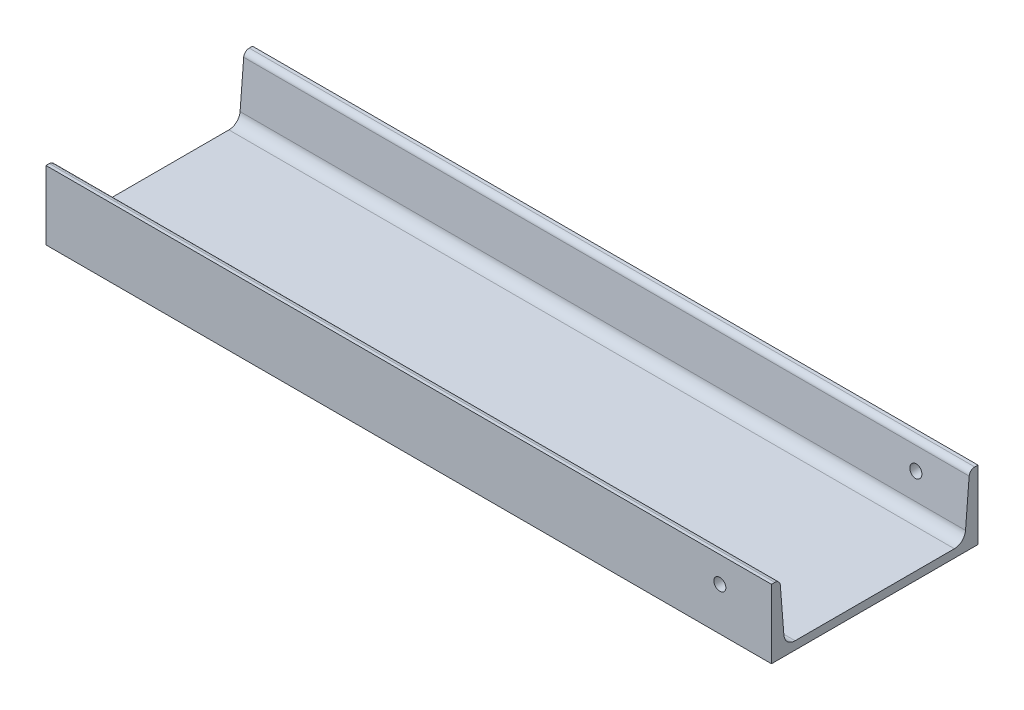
ISO-10303-21;
HEADER;
FILE_DESCRIPTION(('STEP AP214'),'2;1');
FILE_NAME('part.step','',(''),(''),'','','');
FILE_SCHEMA(('AUTOMOTIVE_DESIGN { 1 0 10303 214 1 1 1 1 }'));
ENDSEC;
DATA;
#1=APPLICATION_CONTEXT('core data for automotive mechanical design processes');
#2=APPLICATION_PROTOCOL_DEFINITION('international standard','automotive_design',2000,#1);
#3=PRODUCT_CONTEXT('',#1,'mechanical');
#4=PRODUCT('Part','Part','',(#3));
#5=PRODUCT_RELATED_PRODUCT_CATEGORY('part','',(#4));
#6=PRODUCT_DEFINITION_FORMATION('','',#4);
#7=PRODUCT_DEFINITION_CONTEXT('part definition',#1,'design');
#8=PRODUCT_DEFINITION('design','',#6,#7);
#9=PRODUCT_DEFINITION_SHAPE('','',#8);
#10=(LENGTH_UNIT() NAMED_UNIT(*) SI_UNIT(.MILLI.,.METRE.));
#11=(NAMED_UNIT(*) PLANE_ANGLE_UNIT() SI_UNIT($,.RADIAN.));
#12=(NAMED_UNIT(*) SI_UNIT($,.STERADIAN.) SOLID_ANGLE_UNIT());
#13=UNCERTAINTY_MEASURE_WITH_UNIT(LENGTH_MEASURE(1.E-05),#10,'distance_accuracy_value','');
#14=(GEOMETRIC_REPRESENTATION_CONTEXT(3) GLOBAL_UNCERTAINTY_ASSIGNED_CONTEXT((#13)) GLOBAL_UNIT_ASSIGNED_CONTEXT((#10,
#11,#12)) REPRESENTATION_CONTEXT('',''));
#15=CARTESIAN_POINT('',(0.,0.,0.));
#16=DIRECTION('',(0.,0.,1.));
#17=DIRECTION('',(1.,0.,0.));
#18=AXIS2_PLACEMENT_3D('',#15,#16,#17);
#19=CARTESIAN_POINT('',(843.,0.,-120.));
#20=DIRECTION('',(0.,0.,1.));
#21=DIRECTION('',(0.,-1.,0.));
#22=AXIS2_PLACEMENT_3D('',#19,#20,#21);
#23=PLANE('',#22);
#24=CARTESIAN_POINT('',(783.,50.,-120.));
#25=DIRECTION('',(0.,0.,1.));
#26=DIRECTION('',(1.,0.,0.));
#27=AXIS2_PLACEMENT_3D('',#24,#25,#26);
#28=CIRCLE('',#27,7.00000000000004);
#29=CARTESIAN_POINT('',(790.,50.,-120.));
#30=VERTEX_POINT('',#29);
#31=EDGE_CURVE('E270',#30,#30,#28,.T.);
#32=ORIENTED_EDGE('',*,*,#31,.T.);
#33=EDGE_LOOP('',(#32));
#34=FACE_BOUND('',#33,.T.);
#35=DIRECTION('',(0.,1.,0.));
#36=VECTOR('',#35,1.);
#37=CARTESIAN_POINT('',(0.,0.,-120.));
#38=LINE('',#37,#36);
#39=CARTESIAN_POINT('',(0.,0.,-120.));
#40=VERTEX_POINT('',#39);
#41=CARTESIAN_POINT('',(0.,80.,-120.));
#42=VERTEX_POINT('',#41);
#43=EDGE_CURVE('E122',#40,#42,#38,.T.);
#44=ORIENTED_EDGE('',*,*,#43,.T.);
#45=DIRECTION('',(-1.,0.,0.));
#46=VECTOR('',#45,1.);
#47=CARTESIAN_POINT('',(843.,80.,-120.));
#48=LINE('',#47,#46);
#49=CARTESIAN_POINT('',(843.,80.,-120.));
#50=VERTEX_POINT('',#49);
#51=EDGE_CURVE('E11',#50,#42,#48,.T.);
#52=ORIENTED_EDGE('',*,*,#51,.F.);
#53=DIRECTION('',(0.,1.,0.));
#54=VECTOR('',#53,1.);
#55=CARTESIAN_POINT('',(843.,0.,-120.));
#56=LINE('',#55,#54);
#57=CARTESIAN_POINT('',(843.,0.,-120.));
#58=VERTEX_POINT('',#57);
#59=EDGE_CURVE('E162',#58,#50,#56,.T.);
#60=ORIENTED_EDGE('',*,*,#59,.F.);
#61=DIRECTION('',(-1.,0.,0.));
#62=VECTOR('',#61,1.);
#63=CARTESIAN_POINT('',(843.,0.,-120.));
#64=LINE('',#63,#62);
#65=EDGE_CURVE('E135',#58,#40,#64,.T.);
#66=ORIENTED_EDGE('',*,*,#65,.T.);
#67=EDGE_LOOP('',(#44,#52,#60,#66));
#68=FACE_BOUND('',#67,.T.);
#69=ADVANCED_FACE('F30',(#34,#68),#23,.F.);
#70=CARTESIAN_POINT('',(843.,80.,-120.));
#71=DIRECTION('',(0.,-1.,0.));
#72=DIRECTION('',(0.,0.,-1.));
#73=AXIS2_PLACEMENT_3D('',#70,#71,#72);
#74=PLANE('',#73);
#75=DIRECTION('',(0.,0.,1.));
#76=VECTOR('',#75,1.);
#77=CARTESIAN_POINT('',(0.,80.,-120.));
#78=LINE('',#77,#76);
#79=CARTESIAN_POINT('',(0.,80.,-116.198423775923));
#80=VERTEX_POINT('',#79);
#81=EDGE_CURVE('E118',#42,#80,#78,.T.);
#82=ORIENTED_EDGE('',*,*,#81,.T.);
#83=DIRECTION('',(-1.,0.,0.));
#84=VECTOR('',#83,1.);
#85=CARTESIAN_POINT('',(843.,80.,-116.198423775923));
#86=LINE('',#85,#84);
#87=CARTESIAN_POINT('',(843.,80.,-116.198423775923));
#88=VERTEX_POINT('',#87);
#89=EDGE_CURVE('E37',#88,#80,#86,.T.);
#90=ORIENTED_EDGE('',*,*,#89,.F.);
#91=DIRECTION('',(0.,0.,1.));
#92=VECTOR('',#91,1.);
#93=CARTESIAN_POINT('',(843.,80.,-120.));
#94=LINE('',#93,#92);
#95=EDGE_CURVE('E131',#50,#88,#94,.T.);
#96=ORIENTED_EDGE('',*,*,#95,.F.);
#97=ORIENTED_EDGE('',*,*,#51,.T.);
#98=EDGE_LOOP('',(#82,#90,#96,#97));
#99=FACE_BOUND('',#98,.T.);
#100=ADVANCED_FACE('F130',(#99),#74,.F.);
#101=CARTESIAN_POINT('',(843.,73.5,-116.198423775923));
#102=DIRECTION('',(-1.,0.,0.));
#103=DIRECTION('',(0.,0.,1.));
#104=AXIS2_PLACEMENT_3D('',#101,#102,#103);
#105=CYLINDRICAL_SURFACE('',#104,6.50000000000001);
#106=CARTESIAN_POINT('',(0.,73.5,-116.198423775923));
#107=DIRECTION('',(1.,0.,0.));
#108=DIRECTION('',(0.,0.,-1.));
#109=AXIS2_PLACEMENT_3D('',#106,#107,#108);
#110=CIRCLE('',#109,6.50000000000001);
#111=CARTESIAN_POINT('',(0.,74.0179005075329,-109.719089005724));
#112=VERTEX_POINT('',#111);
#113=EDGE_CURVE('E124',#80,#112,#110,.T.);
#114=ORIENTED_EDGE('',*,*,#113,.T.);
#115=DIRECTION('',(-1.,0.,0.));
#116=VECTOR('',#115,1.);
#117=CARTESIAN_POINT('',(843.,74.0179005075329,-109.719089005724));
#118=LINE('',#117,#116);
#119=CARTESIAN_POINT('',(843.,74.0179005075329,-109.719089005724));
#120=VERTEX_POINT('',#119);
#121=EDGE_CURVE('E208',#120,#112,#118,.T.);
#122=ORIENTED_EDGE('',*,*,#121,.F.);
#123=CARTESIAN_POINT('',(843.,73.5,-116.198423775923));
#124=DIRECTION('',(1.,0.,0.));
#125=DIRECTION('',(0.,0.,-1.));
#126=AXIS2_PLACEMENT_3D('',#123,#124,#125);
#127=CIRCLE('',#126,6.50000000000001);
#128=EDGE_CURVE('E165',#88,#120,#127,.T.);
#129=ORIENTED_EDGE('',*,*,#128,.F.);
#130=ORIENTED_EDGE('',*,*,#89,.T.);
#131=EDGE_LOOP('',(#114,#122,#129,#130));
#132=FACE_BOUND('',#131,.T.);
#133=ADVANCED_FACE('F212',(#132),#105,.T.);
#134=CARTESIAN_POINT('',(843.,74.0179005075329,-109.719089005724));
#135=DIRECTION('',(0.,-0.0796770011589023,-0.996820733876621));
#136=DIRECTION('',(0.,0.996820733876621,-0.0796770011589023));
#137=AXIS2_PLACEMENT_3D('',#134,#135,#136);
#138=PLANE('',#137);
#139=CARTESIAN_POINT('',(783.,50.,-107.79931123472));
#140=DIRECTION('',(0.,-0.0796770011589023,-0.996820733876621));
#141=DIRECTION('',(0.,-0.996820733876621,0.0796770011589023));
#142=AXIS2_PLACEMENT_3D('',#139,#140,#141);
#143=ELLIPSE('',#142,7.02232584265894,7.00000000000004);
#144=CARTESIAN_POINT('',(783.,42.9999999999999,-107.239793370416));
#145=VERTEX_POINT('',#144);
#146=EDGE_CURVE('E136',#145,#145,#143,.T.);
#147=ORIENTED_EDGE('',*,*,#146,.T.);
#148=EDGE_LOOP('',(#147));
#149=FACE_BOUND('',#148,.T.);
#150=DIRECTION('',(0.,-0.99682073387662,0.0796770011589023));
#151=VECTOR('',#150,1.);
#152=CARTESIAN_POINT('',(0.,74.0179005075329,-109.719089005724));
#153=LINE('',#152,#151);
#154=CARTESIAN_POINT('',(0.,21.4641989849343,-105.518412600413));
#155=VERTEX_POINT('',#154);
#156=EDGE_CURVE('E144',#112,#155,#153,.T.);
#157=ORIENTED_EDGE('',*,*,#156,.T.);
#158=DIRECTION('',(-1.,0.,0.));
#159=VECTOR('',#158,1.);
#160=CARTESIAN_POINT('',(843.,21.4641989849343,-105.518412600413));
#161=LINE('',#160,#159);
#162=CARTESIAN_POINT('',(843.,21.4641989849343,-105.518412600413));
#163=VERTEX_POINT('',#162);
#164=EDGE_CURVE('E205',#163,#155,#161,.T.);
#165=ORIENTED_EDGE('',*,*,#164,.F.);
#166=DIRECTION('',(0.,-0.99682073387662,0.0796770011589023));
#167=VECTOR('',#166,1.);
#168=CARTESIAN_POINT('',(843.,74.0179005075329,-109.719089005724));
#169=LINE('',#168,#167);
#170=EDGE_CURVE('E167',#120,#163,#169,.T.);
#171=ORIENTED_EDGE('',*,*,#170,.F.);
#172=ORIENTED_EDGE('',*,*,#121,.T.);
#173=EDGE_LOOP('',(#157,#165,#171,#172));
#174=FACE_BOUND('',#173,.T.);
#175=ADVANCED_FACE('F220',(#149,#174),#138,.F.);
#176=CARTESIAN_POINT('',(843.,22.5,-92.559743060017));
#177=DIRECTION('',(-1.,0.,0.));
#178=DIRECTION('',(0.,0.,1.));
#179=AXIS2_PLACEMENT_3D('',#176,#177,#178);
#180=CYLINDRICAL_SURFACE('',#179,13.);
#181=CARTESIAN_POINT('',(0.,22.5,-92.559743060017));
#182=DIRECTION('',(-1.,0.,0.));
#183=DIRECTION('',(0.,0.,1.));
#184=AXIS2_PLACEMENT_3D('',#181,#182,#183);
#185=CIRCLE('',#184,13.);
#186=CARTESIAN_POINT('',(0.,9.49999999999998,-92.559743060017));
#187=VERTEX_POINT('',#186);
#188=EDGE_CURVE('E146',#155,#187,#185,.T.);
#189=ORIENTED_EDGE('',*,*,#188,.T.);
#190=DIRECTION('',(-1.,0.,0.));
#191=VECTOR('',#190,1.);
#192=CARTESIAN_POINT('',(843.,9.49999999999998,-92.559743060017));
#193=LINE('',#192,#191);
#194=CARTESIAN_POINT('',(843.,9.49999999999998,-92.559743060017));
#195=VERTEX_POINT('',#194);
#196=EDGE_CURVE('E202',#195,#187,#193,.T.);
#197=ORIENTED_EDGE('',*,*,#196,.F.);
#198=CARTESIAN_POINT('',(843.,22.5,-92.559743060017));
#199=DIRECTION('',(-1.,0.,0.));
#200=DIRECTION('',(0.,0.,1.));
#201=AXIS2_PLACEMENT_3D('',#198,#199,#200);
#202=CIRCLE('',#201,13.);
#203=EDGE_CURVE('E169',#163,#195,#202,.T.);
#204=ORIENTED_EDGE('',*,*,#203,.F.);
#205=ORIENTED_EDGE('',*,*,#164,.T.);
#206=EDGE_LOOP('',(#189,#197,#204,#205));
#207=FACE_BOUND('',#206,.T.);
#208=ADVANCED_FACE('F223',(#207),#180,.F.);
#209=CARTESIAN_POINT('',(843.,9.49999999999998,-92.559743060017));
#210=DIRECTION('',(0.,-1.,0.));
#211=DIRECTION('',(0.,0.,-1.));
#212=AXIS2_PLACEMENT_3D('',#209,#210,#211);
#213=PLANE('',#212);
#214=DIRECTION('',(0.,0.,1.));
#215=VECTOR('',#214,1.);
#216=CARTESIAN_POINT('',(0.,9.49999999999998,-92.559743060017));
#217=LINE('',#216,#215);
#218=CARTESIAN_POINT('',(0.,9.49999999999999,92.559743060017));
#219=VERTEX_POINT('',#218);
#220=EDGE_CURVE('E148',#187,#219,#217,.T.);
#221=ORIENTED_EDGE('',*,*,#220,.T.);
#222=DIRECTION('',(-1.,0.,0.));
#223=VECTOR('',#222,1.);
#224=CARTESIAN_POINT('',(843.,9.49999999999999,92.559743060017));
#225=LINE('',#224,#223);
#226=CARTESIAN_POINT('',(843.,9.49999999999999,92.559743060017));
#227=VERTEX_POINT('',#226);
#228=EDGE_CURVE('E199',#227,#219,#225,.T.);
#229=ORIENTED_EDGE('',*,*,#228,.F.);
#230=DIRECTION('',(0.,0.,1.));
#231=VECTOR('',#230,1.);
#232=CARTESIAN_POINT('',(843.,9.49999999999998,-92.559743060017));
#233=LINE('',#232,#231);
#234=EDGE_CURVE('E171',#195,#227,#233,.T.);
#235=ORIENTED_EDGE('',*,*,#234,.F.);
#236=ORIENTED_EDGE('',*,*,#196,.T.);
#237=EDGE_LOOP('',(#221,#229,#235,#236));
#238=FACE_BOUND('',#237,.T.);
#239=ADVANCED_FACE('F228',(#238),#213,.F.);
#240=CARTESIAN_POINT('',(843.,22.5,92.559743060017));
#241=DIRECTION('',(-1.,0.,0.));
#242=DIRECTION('',(0.,0.,1.));
#243=AXIS2_PLACEMENT_3D('',#240,#241,#242);
#244=CYLINDRICAL_SURFACE('',#243,13.);
#245=CARTESIAN_POINT('',(0.,22.5,92.559743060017));
#246=DIRECTION('',(-1.,0.,0.));
#247=DIRECTION('',(0.,0.,-1.));
#248=AXIS2_PLACEMENT_3D('',#245,#246,#247);
#249=CIRCLE('',#248,13.);
#250=CARTESIAN_POINT('',(0.,21.4641989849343,105.518412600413));
#251=VERTEX_POINT('',#250);
#252=EDGE_CURVE('E150',#219,#251,#249,.T.);
#253=ORIENTED_EDGE('',*,*,#252,.T.);
#254=DIRECTION('',(-1.,0.,0.));
#255=VECTOR('',#254,1.);
#256=CARTESIAN_POINT('',(843.,21.4641989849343,105.518412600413));
#257=LINE('',#256,#255);
#258=CARTESIAN_POINT('',(843.,21.4641989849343,105.518412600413));
#259=VERTEX_POINT('',#258);
#260=EDGE_CURVE('E196',#259,#251,#257,.T.);
#261=ORIENTED_EDGE('',*,*,#260,.F.);
#262=CARTESIAN_POINT('',(843.,22.5,92.559743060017));
#263=DIRECTION('',(-1.,0.,0.));
#264=DIRECTION('',(0.,0.,-1.));
#265=AXIS2_PLACEMENT_3D('',#262,#263,#264);
#266=CIRCLE('',#265,13.);
#267=EDGE_CURVE('E173',#227,#259,#266,.T.);
#268=ORIENTED_EDGE('',*,*,#267,.F.);
#269=ORIENTED_EDGE('',*,*,#228,.T.);
#270=EDGE_LOOP('',(#253,#261,#268,#269));
#271=FACE_BOUND('',#270,.T.);
#272=ADVANCED_FACE('F234',(#271),#244,.F.);
#273=CARTESIAN_POINT('',(843.,74.0179005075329,109.719089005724));
#274=DIRECTION('',(0.,-0.0796770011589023,0.996820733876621));
#275=DIRECTION('',(0.,-0.996820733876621,-0.0796770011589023));
#276=AXIS2_PLACEMENT_3D('',#273,#274,#275);
#277=PLANE('',#276);
#278=CARTESIAN_POINT('',(783.,50.,107.79931123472));
#279=DIRECTION('',(0.,-0.0796770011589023,0.996820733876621));
#280=DIRECTION('',(0.,0.996820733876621,0.0796770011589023));
#281=AXIS2_PLACEMENT_3D('',#278,#279,#280);
#282=ELLIPSE('',#281,7.02232584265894,7.00000000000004);
#283=CARTESIAN_POINT('',(783.,57.,108.358829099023));
#284=VERTEX_POINT('',#283);
#285=EDGE_CURVE('E139',#284,#284,#282,.T.);
#286=ORIENTED_EDGE('',*,*,#285,.T.);
#287=EDGE_LOOP('',(#286));
#288=FACE_BOUND('',#287,.T.);
#289=DIRECTION('',(0.,0.99682073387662,0.0796770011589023));
#290=VECTOR('',#289,1.);
#291=CARTESIAN_POINT('',(0.,74.0179005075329,109.719089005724));
#292=LINE('',#291,#290);
#293=CARTESIAN_POINT('',(0.,74.0179005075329,109.719089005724));
#294=VERTEX_POINT('',#293);
#295=EDGE_CURVE('E152',#251,#294,#292,.T.);
#296=ORIENTED_EDGE('',*,*,#295,.T.);
#297=DIRECTION('',(-1.,0.,0.));
#298=VECTOR('',#297,1.);
#299=CARTESIAN_POINT('',(843.,74.0179005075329,109.719089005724));
#300=LINE('',#299,#298);
#301=CARTESIAN_POINT('',(843.,74.0179005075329,109.719089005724));
#302=VERTEX_POINT('',#301);
#303=EDGE_CURVE('E193',#302,#294,#300,.T.);
#304=ORIENTED_EDGE('',*,*,#303,.F.);
#305=DIRECTION('',(0.,0.99682073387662,0.0796770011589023));
#306=VECTOR('',#305,1.);
#307=CARTESIAN_POINT('',(843.,74.0179005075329,109.719089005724));
#308=LINE('',#307,#306);
#309=EDGE_CURVE('E175',#259,#302,#308,.T.);
#310=ORIENTED_EDGE('',*,*,#309,.F.);
#311=ORIENTED_EDGE('',*,*,#260,.T.);
#312=EDGE_LOOP('',(#296,#304,#310,#311));
#313=FACE_BOUND('',#312,.T.);
#314=ADVANCED_FACE('F238',(#288,#313),#277,.F.);
#315=CARTESIAN_POINT('',(843.,73.5,116.198423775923));
#316=DIRECTION('',(-1.,0.,0.));
#317=DIRECTION('',(0.,0.,1.));
#318=AXIS2_PLACEMENT_3D('',#315,#316,#317);
#319=CYLINDRICAL_SURFACE('',#318,6.50000000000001);
#320=CARTESIAN_POINT('',(0.,73.5,116.198423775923));
#321=DIRECTION('',(1.,0.,0.));
#322=DIRECTION('',(0.,0.,1.));
#323=AXIS2_PLACEMENT_3D('',#320,#321,#322);
#324=CIRCLE('',#323,6.50000000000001);
#325=CARTESIAN_POINT('',(0.,80.,116.198423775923));
#326=VERTEX_POINT('',#325);
#327=EDGE_CURVE('E154',#294,#326,#324,.T.);
#328=ORIENTED_EDGE('',*,*,#327,.T.);
#329=DIRECTION('',(-1.,0.,0.));
#330=VECTOR('',#329,1.);
#331=CARTESIAN_POINT('',(843.,80.,116.198423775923));
#332=LINE('',#331,#330);
#333=CARTESIAN_POINT('',(843.,80.,116.198423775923));
#334=VERTEX_POINT('',#333);
#335=EDGE_CURVE('E190',#334,#326,#332,.T.);
#336=ORIENTED_EDGE('',*,*,#335,.F.);
#337=CARTESIAN_POINT('',(843.,73.5,116.198423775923));
#338=DIRECTION('',(1.,0.,0.));
#339=DIRECTION('',(0.,0.,1.));
#340=AXIS2_PLACEMENT_3D('',#337,#338,#339);
#341=CIRCLE('',#340,6.50000000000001);
#342=EDGE_CURVE('E177',#302,#334,#341,.T.);
#343=ORIENTED_EDGE('',*,*,#342,.F.);
#344=ORIENTED_EDGE('',*,*,#303,.T.);
#345=EDGE_LOOP('',(#328,#336,#343,#344));
#346=FACE_BOUND('',#345,.T.);
#347=ADVANCED_FACE('F243',(#346),#319,.T.);
#348=CARTESIAN_POINT('',(843.,80.,120.));
#349=DIRECTION('',(0.,-1.,0.));
#350=DIRECTION('',(0.,0.,-1.));
#351=AXIS2_PLACEMENT_3D('',#348,#349,#350);
#352=PLANE('',#351);
#353=DIRECTION('',(0.,0.,1.));
#354=VECTOR('',#353,1.);
#355=CARTESIAN_POINT('',(0.,80.,120.));
#356=LINE('',#355,#354);
#357=CARTESIAN_POINT('',(0.,80.,120.));
#358=VERTEX_POINT('',#357);
#359=EDGE_CURVE('E156',#326,#358,#356,.T.);
#360=ORIENTED_EDGE('',*,*,#359,.T.);
#361=DIRECTION('',(-1.,0.,0.));
#362=VECTOR('',#361,1.);
#363=CARTESIAN_POINT('',(843.,80.,120.));
#364=LINE('',#363,#362);
#365=CARTESIAN_POINT('',(843.,80.,120.));
#366=VERTEX_POINT('',#365);
#367=EDGE_CURVE('E187',#366,#358,#364,.T.);
#368=ORIENTED_EDGE('',*,*,#367,.F.);
#369=DIRECTION('',(0.,0.,1.));
#370=VECTOR('',#369,1.);
#371=CARTESIAN_POINT('',(843.,80.,120.));
#372=LINE('',#371,#370);
#373=EDGE_CURVE('E179',#334,#366,#372,.T.);
#374=ORIENTED_EDGE('',*,*,#373,.F.);
#375=ORIENTED_EDGE('',*,*,#335,.T.);
#376=EDGE_LOOP('',(#360,#368,#374,#375));
#377=FACE_BOUND('',#376,.T.);
#378=ADVANCED_FACE('F247',(#377),#352,.F.);
#379=CARTESIAN_POINT('',(843.,0.,120.));
#380=DIRECTION('',(0.,0.,-1.));
#381=DIRECTION('',(0.,1.,0.));
#382=AXIS2_PLACEMENT_3D('',#379,#380,#381);
#383=PLANE('',#382);
#384=CARTESIAN_POINT('',(783.,50.,120.));
#385=DIRECTION('',(0.,0.,1.));
#386=DIRECTION('',(1.,0.,0.));
#387=AXIS2_PLACEMENT_3D('',#384,#385,#386);
#388=CIRCLE('',#387,7.00000000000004);
#389=CARTESIAN_POINT('',(790.,50.,120.));
#390=VERTEX_POINT('',#389);
#391=EDGE_CURVE('E272',#390,#390,#388,.T.);
#392=ORIENTED_EDGE('',*,*,#391,.F.);
#393=EDGE_LOOP('',(#392));
#394=FACE_BOUND('',#393,.T.);
#395=DIRECTION('',(0.,-1.,0.));
#396=VECTOR('',#395,1.);
#397=CARTESIAN_POINT('',(0.,0.,120.));
#398=LINE('',#397,#396);
#399=CARTESIAN_POINT('',(0.,0.,120.));
#400=VERTEX_POINT('',#399);
#401=EDGE_CURVE('E158',#358,#400,#398,.T.);
#402=ORIENTED_EDGE('',*,*,#401,.T.);
#403=DIRECTION('',(-1.,0.,0.));
#404=VECTOR('',#403,1.);
#405=CARTESIAN_POINT('',(843.,0.,120.));
#406=LINE('',#405,#404);
#407=CARTESIAN_POINT('',(843.,0.,120.));
#408=VERTEX_POINT('',#407);
#409=EDGE_CURVE('E184',#408,#400,#406,.T.);
#410=ORIENTED_EDGE('',*,*,#409,.F.);
#411=DIRECTION('',(0.,-1.,0.));
#412=VECTOR('',#411,1.);
#413=CARTESIAN_POINT('',(843.,0.,120.));
#414=LINE('',#413,#412);
#415=EDGE_CURVE('E49',#366,#408,#414,.T.);
#416=ORIENTED_EDGE('',*,*,#415,.F.);
#417=ORIENTED_EDGE('',*,*,#367,.T.);
#418=EDGE_LOOP('',(#402,#410,#416,#417));
#419=FACE_BOUND('',#418,.T.);
#420=ADVANCED_FACE('F251',(#394,#419),#383,.F.);
#421=CARTESIAN_POINT('',(843.,0.,120.));
#422=DIRECTION('',(0.,1.,0.));
#423=DIRECTION('',(0.,0.,1.));
#424=AXIS2_PLACEMENT_3D('',#421,#422,#423);
#425=PLANE('',#424);
#426=DIRECTION('',(0.,0.,-1.));
#427=VECTOR('',#426,1.);
#428=CARTESIAN_POINT('',(0.,0.,120.));
#429=LINE('',#428,#427);
#430=EDGE_CURVE('E160',#400,#40,#429,.T.);
#431=ORIENTED_EDGE('',*,*,#430,.T.);
#432=ORIENTED_EDGE('',*,*,#65,.F.);
#433=DIRECTION('',(0.,0.,-1.));
#434=VECTOR('',#433,1.);
#435=CARTESIAN_POINT('',(843.,0.,120.));
#436=LINE('',#435,#434);
#437=EDGE_CURVE('E44',#408,#58,#436,.T.);
#438=ORIENTED_EDGE('',*,*,#437,.F.);
#439=ORIENTED_EDGE('',*,*,#409,.T.);
#440=EDGE_LOOP('',(#431,#432,#438,#439));
#441=FACE_BOUND('',#440,.T.);
#442=ADVANCED_FACE('F253',(#441),#425,.F.);
#443=CARTESIAN_POINT('',(843.,73.5,-116.198423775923));
#444=DIRECTION('',(1.,0.,0.));
#445=DIRECTION('',(0.,0.,-1.));
#446=AXIS2_PLACEMENT_3D('',#443,#444,#445);
#447=PLANE('',#446);
#448=ORIENTED_EDGE('',*,*,#59,.T.);
#449=ORIENTED_EDGE('',*,*,#95,.T.);
#450=ORIENTED_EDGE('',*,*,#128,.T.);
#451=ORIENTED_EDGE('',*,*,#170,.T.);
#452=ORIENTED_EDGE('',*,*,#203,.T.);
#453=ORIENTED_EDGE('',*,*,#234,.T.);
#454=ORIENTED_EDGE('',*,*,#267,.T.);
#455=ORIENTED_EDGE('',*,*,#309,.T.);
#456=ORIENTED_EDGE('',*,*,#342,.T.);
#457=ORIENTED_EDGE('',*,*,#373,.T.);
#458=ORIENTED_EDGE('',*,*,#415,.T.);
#459=ORIENTED_EDGE('',*,*,#437,.T.);
#460=EDGE_LOOP('',(#448,#449,#450,#451,#452,#453,#454,#455,#456,#457,#458,#459));
#461=FACE_BOUND('',#460,.T.);
#462=ADVANCED_FACE('F215',(#461),#447,.T.);
#463=CARTESIAN_POINT('',(0.,73.5,-116.198423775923));
#464=DIRECTION('',(1.,0.,0.));
#465=DIRECTION('',(0.,0.,-1.));
#466=AXIS2_PLACEMENT_3D('',#463,#464,#465);
#467=PLANE('',#466);
#468=ORIENTED_EDGE('',*,*,#43,.F.);
#469=ORIENTED_EDGE('',*,*,#430,.F.);
#470=ORIENTED_EDGE('',*,*,#401,.F.);
#471=ORIENTED_EDGE('',*,*,#359,.F.);
#472=ORIENTED_EDGE('',*,*,#327,.F.);
#473=ORIENTED_EDGE('',*,*,#295,.F.);
#474=ORIENTED_EDGE('',*,*,#252,.F.);
#475=ORIENTED_EDGE('',*,*,#220,.F.);
#476=ORIENTED_EDGE('',*,*,#188,.F.);
#477=ORIENTED_EDGE('',*,*,#156,.F.);
#478=ORIENTED_EDGE('',*,*,#113,.F.);
#479=ORIENTED_EDGE('',*,*,#81,.F.);
#480=EDGE_LOOP('',(#468,#469,#470,#471,#472,#473,#474,#475,#476,#477,#478,#479));
#481=FACE_BOUND('',#480,.T.);
#482=ADVANCED_FACE('F119',(#481),#467,.F.);
#483=CARTESIAN_POINT('',(783.,50.,-120.));
#484=DIRECTION('',(0.,0.,1.));
#485=DIRECTION('',(1.,0.,0.));
#486=AXIS2_PLACEMENT_3D('',#483,#484,#485);
#487=CYLINDRICAL_SURFACE('',#486,7.00000000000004);
#488=ORIENTED_EDGE('',*,*,#391,.T.);
#489=EDGE_LOOP('',(#488));
#490=FACE_BOUND('',#489,.T.);
#491=ORIENTED_EDGE('',*,*,#285,.F.);
#492=EDGE_LOOP('',(#491));
#493=FACE_BOUND('',#492,.T.);
#494=ADVANCED_FACE('F279',(#490,#493),#487,.F.);
#495=ORIENTED_EDGE('',*,*,#31,.F.);
#496=EDGE_LOOP('',(#495));
#497=FACE_BOUND('',#496,.T.);
#498=ORIENTED_EDGE('',*,*,#146,.F.);
#499=EDGE_LOOP('',(#498));
#500=FACE_BOUND('',#499,.T.);
#501=ADVANCED_FACE('F282',(#497,#500),#487,.F.);
#502=CLOSED_SHELL('',(#69,#100,#133,#175,#208,#239,#272,#314,#347,#378,#420,#442,#462,#482,#494,#501));
#503=MANIFOLD_SOLID_BREP('B2',#502);
#504=ADVANCED_BREP_SHAPE_REPRESENTATION('',(#18,#503),#14);
#505=SHAPE_DEFINITION_REPRESENTATION(#9,#504);
ENDSEC;
END-ISO-10303-21;
